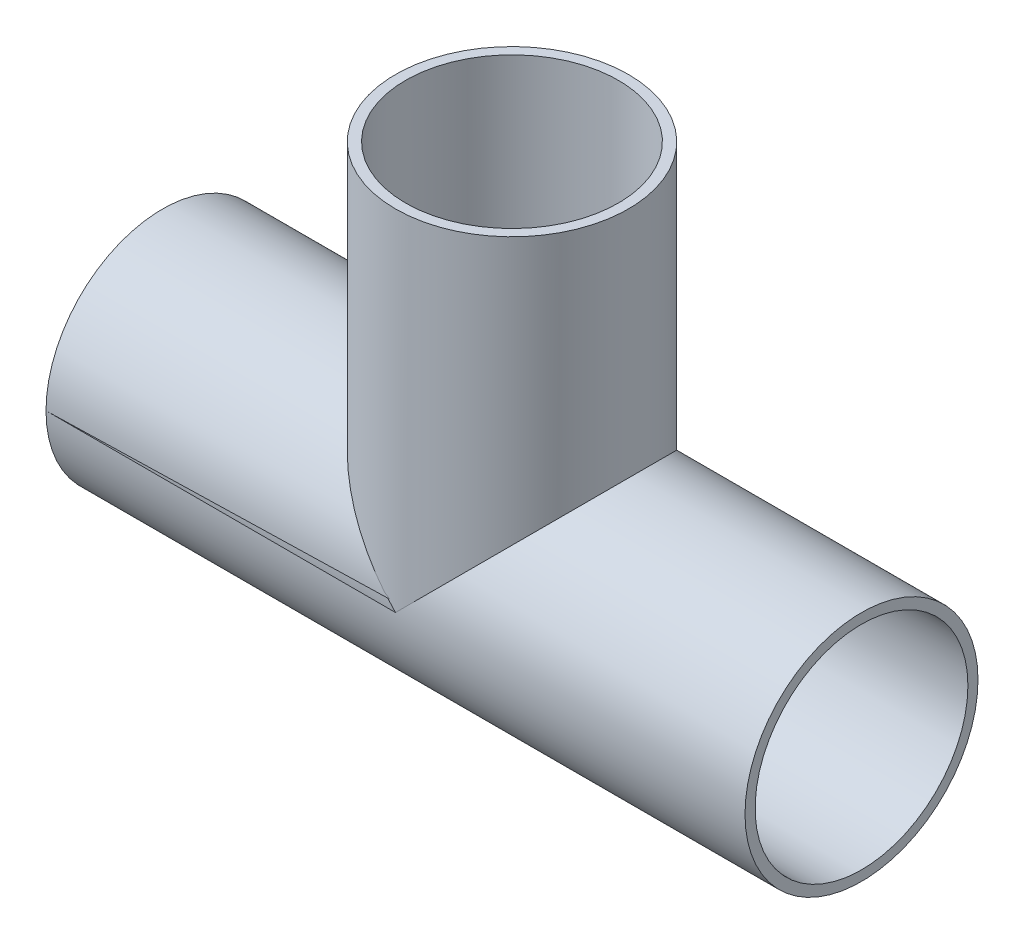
ISO-10303-21;
HEADER;
FILE_DESCRIPTION(('STEP AP214'),'2;1');
FILE_NAME('part.step','',(''),(''),'','','');
FILE_SCHEMA(('AUTOMOTIVE_DESIGN { 1 0 10303 214 1 1 1 1 }'));
ENDSEC;
DATA;
#1=APPLICATION_CONTEXT('core data for automotive mechanical design processes');
#2=APPLICATION_PROTOCOL_DEFINITION('international standard','automotive_design',2000,#1);
#3=PRODUCT_CONTEXT('',#1,'mechanical');
#4=PRODUCT('Part','Part','',(#3));
#5=PRODUCT_RELATED_PRODUCT_CATEGORY('part','',(#4));
#6=PRODUCT_DEFINITION_FORMATION('','',#4);
#7=PRODUCT_DEFINITION_CONTEXT('part definition',#1,'design');
#8=PRODUCT_DEFINITION('design','',#6,#7);
#9=PRODUCT_DEFINITION_SHAPE('','',#8);
#10=(LENGTH_UNIT() NAMED_UNIT(*) SI_UNIT(.MILLI.,.METRE.));
#11=(NAMED_UNIT(*) PLANE_ANGLE_UNIT() SI_UNIT($,.RADIAN.));
#12=(NAMED_UNIT(*) SI_UNIT($,.STERADIAN.) SOLID_ANGLE_UNIT());
#13=UNCERTAINTY_MEASURE_WITH_UNIT(LENGTH_MEASURE(1.E-05),#10,'distance_accuracy_value','');
#14=(GEOMETRIC_REPRESENTATION_CONTEXT(3) GLOBAL_UNCERTAINTY_ASSIGNED_CONTEXT((#13)) GLOBAL_UNIT_ASSIGNED_CONTEXT((#10,
#11,#12)) REPRESENTATION_CONTEXT('',''));
#15=CARTESIAN_POINT('',(0.,0.,0.));
#16=DIRECTION('',(0.,0.,1.));
#17=DIRECTION('',(1.,0.,0.));
#18=AXIS2_PLACEMENT_3D('',#15,#16,#17);
#19=CARTESIAN_POINT('',(0.,57.15,0.));
#20=DIRECTION('',(0.,-1.,0.));
#21=DIRECTION('',(0.,0.,-1.));
#22=AXIS2_PLACEMENT_3D('',#19,#20,#21);
#23=CYLINDRICAL_SURFACE('',#22,19.05);
#24=CARTESIAN_POINT('',(0.,57.15,0.));
#25=DIRECTION('',(0.,1.,0.));
#26=DIRECTION('',(0.,0.,1.));
#27=AXIS2_PLACEMENT_3D('',#24,#25,#26);
#28=CIRCLE('',#27,19.05);
#29=CARTESIAN_POINT('',(0.,57.15,19.05));
#30=VERTEX_POINT('',#29);
#31=EDGE_CURVE('E11',#30,#30,#28,.T.);
#32=ORIENTED_EDGE('',*,*,#31,.F.);
#33=EDGE_LOOP('',(#32));
#34=FACE_BOUND('',#33,.T.);
#35=CARTESIAN_POINT('',(0.,0.,0.));
#36=DIRECTION('',(-0.707106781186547,-0.707106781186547,0.));
#37=DIRECTION('',(0.707106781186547,-0.707106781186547,0.));
#38=AXIS2_PLACEMENT_3D('',#35,#36,#37);
#39=ELLIPSE('',#38,26.9407683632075,19.05);
#40=CARTESIAN_POINT('',(0.,0.,19.05));
#41=VERTEX_POINT('',#40);
#42=CARTESIAN_POINT('',(0.,0.,-19.05));
#43=VERTEX_POINT('',#42);
#44=EDGE_CURVE('E40',#41,#43,#39,.T.);
#45=ORIENTED_EDGE('',*,*,#44,.F.);
#46=CARTESIAN_POINT('',(0.,0.,0.));
#47=DIRECTION('',(0.707106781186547,-0.707106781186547,0.));
#48=DIRECTION('',(-0.707106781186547,-0.707106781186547,0.));
#49=AXIS2_PLACEMENT_3D('',#46,#47,#48);
#50=ELLIPSE('',#49,26.9407683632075,19.05);
#51=EDGE_CURVE('E53',#43,#41,#50,.T.);
#52=ORIENTED_EDGE('',*,*,#51,.F.);
#53=EDGE_LOOP('',(#45,#52));
#54=FACE_BOUND('',#53,.T.);
#55=ADVANCED_FACE('F33',(#34,#54),#23,.T.);
#56=CARTESIAN_POINT('',(0.,57.15,0.));
#57=DIRECTION('',(0.,1.,0.));
#58=DIRECTION('',(0.,0.,1.));
#59=AXIS2_PLACEMENT_3D('',#56,#57,#58);
#60=PLANE('',#59);
#61=CARTESIAN_POINT('',(0.,57.15,0.));
#62=DIRECTION('',(0.,1.,0.));
#63=DIRECTION('',(0.,0.,1.));
#64=AXIS2_PLACEMENT_3D('',#61,#62,#63);
#65=CIRCLE('',#64,17.399);
#66=CARTESIAN_POINT('',(0.,57.15,17.399));
#67=VERTEX_POINT('',#66);
#68=EDGE_CURVE('E65',#67,#67,#65,.T.);
#69=ORIENTED_EDGE('',*,*,#68,.F.);
#70=EDGE_LOOP('',(#69));
#71=FACE_BOUND('',#70,.T.);
#72=ORIENTED_EDGE('',*,*,#31,.T.);
#73=EDGE_LOOP('',(#72));
#74=FACE_BOUND('',#73,.T.);
#75=ADVANCED_FACE('F80',(#71,#74),#60,.T.);
#76=CARTESIAN_POINT('',(57.15,0.,0.));
#77=DIRECTION('',(-1.,0.,0.));
#78=DIRECTION('',(0.,0.,1.));
#79=AXIS2_PLACEMENT_3D('',#76,#77,#78);
#80=CYLINDRICAL_SURFACE('',#79,19.05);
#81=CARTESIAN_POINT('',(-57.15,0.,0.));
#82=DIRECTION('',(1.,0.,0.));
#83=DIRECTION('',(0.,0.,-1.));
#84=AXIS2_PLACEMENT_3D('',#81,#82,#83);
#85=CIRCLE('',#84,19.05);
#86=CARTESIAN_POINT('',(-57.15,0.,-19.05));
#87=VERTEX_POINT('',#86);
#88=EDGE_CURVE('E68',#87,#87,#85,.T.);
#89=ORIENTED_EDGE('',*,*,#88,.T.);
#90=EDGE_LOOP('',(#89));
#91=FACE_BOUND('',#90,.T.);
#92=CARTESIAN_POINT('',(57.15,0.,0.));
#93=DIRECTION('',(1.,0.,0.));
#94=DIRECTION('',(0.,0.,-1.));
#95=AXIS2_PLACEMENT_3D('',#92,#93,#94);
#96=CIRCLE('',#95,19.05);
#97=CARTESIAN_POINT('',(57.15,0.,-19.05));
#98=VERTEX_POINT('',#97);
#99=EDGE_CURVE('E72',#98,#98,#96,.T.);
#100=ORIENTED_EDGE('',*,*,#99,.F.);
#101=EDGE_LOOP('',(#100));
#102=FACE_BOUND('',#101,.T.);
#103=ORIENTED_EDGE('',*,*,#51,.T.);
#104=ORIENTED_EDGE('',*,*,#44,.T.);
#105=EDGE_LOOP('',(#103,#104));
#106=FACE_BOUND('',#105,.T.);
#107=ADVANCED_FACE('F78',(#91,#102,#106),#80,.T.);
#108=CARTESIAN_POINT('',(57.15,0.,0.));
#109=DIRECTION('',(1.,0.,0.));
#110=DIRECTION('',(0.,0.,-1.));
#111=AXIS2_PLACEMENT_3D('',#108,#109,#110);
#112=PLANE('',#111);
#113=CARTESIAN_POINT('',(57.15,0.,0.));
#114=DIRECTION('',(1.,0.,0.));
#115=DIRECTION('',(0.,0.,-1.));
#116=AXIS2_PLACEMENT_3D('',#113,#114,#115);
#117=CIRCLE('',#116,17.399);
#118=CARTESIAN_POINT('',(57.15,0.,-17.399));
#119=VERTEX_POINT('',#118);
#120=EDGE_CURVE('E112',#119,#119,#117,.T.);
#121=ORIENTED_EDGE('',*,*,#120,.F.);
#122=EDGE_LOOP('',(#121));
#123=FACE_BOUND('',#122,.T.);
#124=ORIENTED_EDGE('',*,*,#99,.T.);
#125=EDGE_LOOP('',(#124));
#126=FACE_BOUND('',#125,.T.);
#127=ADVANCED_FACE('F91',(#123,#126),#112,.T.);
#128=CARTESIAN_POINT('',(-57.15,0.,0.));
#129=DIRECTION('',(1.,0.,0.));
#130=DIRECTION('',(0.,0.,-1.));
#131=AXIS2_PLACEMENT_3D('',#128,#129,#130);
#132=PLANE('',#131);
#133=CARTESIAN_POINT('',(-57.15,0.,0.));
#134=DIRECTION('',(1.,0.,0.));
#135=DIRECTION('',(0.,0.,-1.));
#136=AXIS2_PLACEMENT_3D('',#133,#134,#135);
#137=CIRCLE('',#136,17.399);
#138=CARTESIAN_POINT('',(-57.15,0.,-17.399));
#139=VERTEX_POINT('',#138);
#140=EDGE_CURVE('E61',#139,#139,#137,.T.);
#141=ORIENTED_EDGE('',*,*,#140,.T.);
#142=EDGE_LOOP('',(#141));
#143=FACE_BOUND('',#142,.T.);
#144=ORIENTED_EDGE('',*,*,#88,.F.);
#145=EDGE_LOOP('',(#144));
#146=FACE_BOUND('',#145,.T.);
#147=ADVANCED_FACE('F96',(#143,#146),#132,.F.);
#148=CARTESIAN_POINT('',(0.,0.,0.));
#149=DIRECTION('',(0.,1.,0.));
#150=DIRECTION('',(0.,0.,1.));
#151=AXIS2_PLACEMENT_3D('',#148,#149,#150);
#152=CYLINDRICAL_SURFACE('',#151,17.399);
#153=CARTESIAN_POINT('',(0.,0.,0.));
#154=DIRECTION('',(-0.707106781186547,0.707106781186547,0.));
#155=DIRECTION('',(0.707106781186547,0.707106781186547,0.));
#156=AXIS2_PLACEMENT_3D('',#153,#154,#155);
#157=ELLIPSE('',#156,24.6059017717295,17.399);
#158=CARTESIAN_POINT('',(0.,0.,-17.399));
#159=VERTEX_POINT('',#158);
#160=CARTESIAN_POINT('',(0.,0.,17.399));
#161=VERTEX_POINT('',#160);
#162=EDGE_CURVE('E58',#159,#161,#157,.F.);
#163=ORIENTED_EDGE('',*,*,#162,.T.);
#164=CARTESIAN_POINT('',(0.,0.,0.));
#165=DIRECTION('',(0.707106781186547,0.707106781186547,0.));
#166=DIRECTION('',(-0.707106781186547,0.707106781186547,0.));
#167=AXIS2_PLACEMENT_3D('',#164,#165,#166);
#168=ELLIPSE('',#167,24.6059017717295,17.399);
#169=EDGE_CURVE('E46',#161,#159,#168,.F.);
#170=ORIENTED_EDGE('',*,*,#169,.T.);
#171=EDGE_LOOP('',(#163,#170));
#172=FACE_BOUND('',#171,.T.);
#173=ORIENTED_EDGE('',*,*,#68,.T.);
#174=EDGE_LOOP('',(#173));
#175=FACE_BOUND('',#174,.T.);
#176=ADVANCED_FACE('F63',(#172,#175),#152,.F.);
#177=CARTESIAN_POINT('',(-57.15,0.,0.));
#178=DIRECTION('',(1.,0.,0.));
#179=DIRECTION('',(0.,0.,-1.));
#180=AXIS2_PLACEMENT_3D('',#177,#178,#179);
#181=CYLINDRICAL_SURFACE('',#180,17.399);
#182=ORIENTED_EDGE('',*,*,#120,.T.);
#183=EDGE_LOOP('',(#182));
#184=FACE_BOUND('',#183,.T.);
#185=ORIENTED_EDGE('',*,*,#140,.F.);
#186=EDGE_LOOP('',(#185));
#187=FACE_BOUND('',#186,.T.);
#188=ORIENTED_EDGE('',*,*,#162,.F.);
#189=ORIENTED_EDGE('',*,*,#169,.F.);
#190=EDGE_LOOP('',(#188,#189));
#191=FACE_BOUND('',#190,.T.);
#192=ADVANCED_FACE('F59',(#184,#187,#191),#181,.F.);
#193=CLOSED_SHELL('',(#55,#75,#107,#127,#147,#176,#192));
#194=MANIFOLD_SOLID_BREP('B2',#193);
#195=ADVANCED_BREP_SHAPE_REPRESENTATION('',(#18,#194),#14);
#196=SHAPE_DEFINITION_REPRESENTATION(#9,#195);
ENDSEC;
END-ISO-10303-21;
